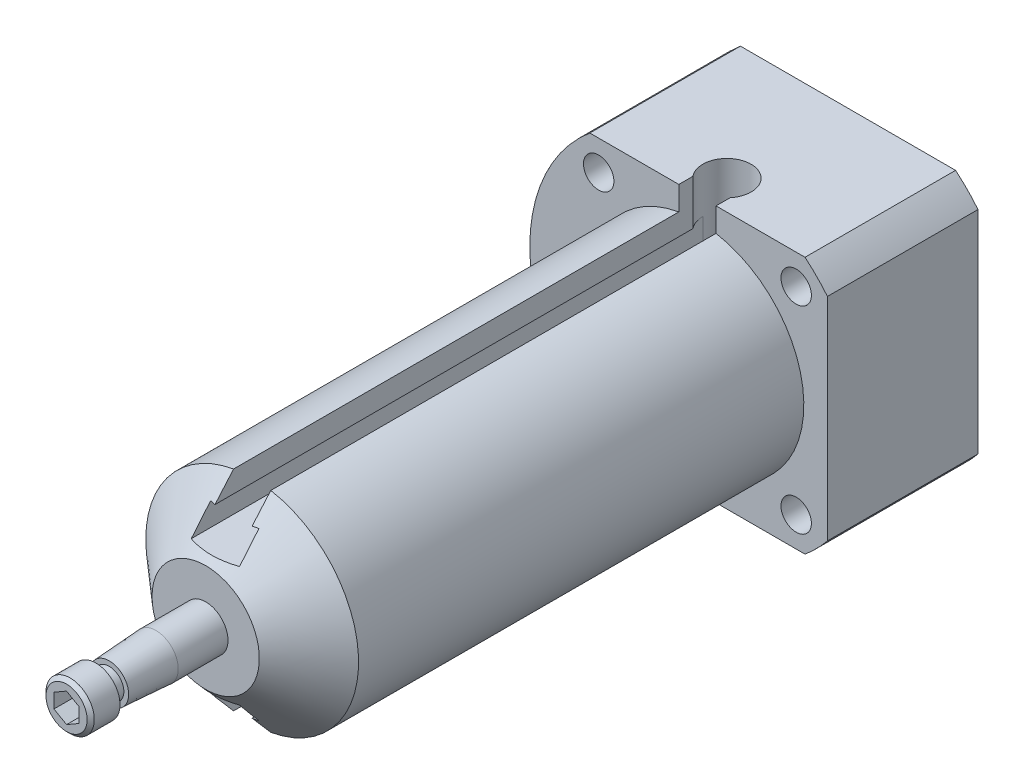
from build123d import *

# Parameters (mm, degrees)
EXTRUDE1_DEPTH     = 91.2368
HOLE1_D            = 3.4544
HOLE1_DEPTH        = 19.05
HOLE1_TIP          = 1.037806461
HOLE2_D            = 4.318
CIRPATTERN1_COUNT  = 4
CUT_EXTRUDE1_DEPTH = 74.041
CUT_EXTRUDE2_DEPTH = 53.975
CUT_EXTRUDE3_REACH = 115.64
SKETCH14_R         = 3.429
CUT_EXTRUDE4_REACH = 115.64
SKETCH15_R         = 3.429
CUT_EXTRUDE5_DEPTH = 3.175


with BuildPart() as part:
    # Sketch1 → Extrude1 (new body)
    with BuildSketch(Plane.XY):
        with BuildLine():
            Line((-15.281118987, 18.2626), (15.281118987, 18.2626))
            ThreePointArc((15.281118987, 18.2626), (16.95045971, 16.724744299), (18.4658, 15.034938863))
            Line((18.4658, 15.034938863), (18.4658, -15.034938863))
            ThreePointArc((18.4658, -15.034938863), (16.95045971, -16.724744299), (15.281118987, -18.2626))
            Line((15.281118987, -18.2626), (-15.281118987, -18.2626))
            ThreePointArc((-15.281118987, -18.2626), (-23.8125, 0), (-15.281118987, 18.2626))
        make_face()
    extrude(amount=EXTRUDE1_DEPTH)

    # Sketch2 → Cut-Revolve1 (revolve, cut)
    with BuildSketch(Plane(origin=(0, 0, 0), x_dir=(1, 0, 0), z_dir=(0, 1, 0))):
        Polygon((-23.8125, -21.3868), (-15.113, -21.3868), (-15.113, -84.6328), (-7.62, -91.2368), (-23.8125, -91.2368), align=None)
    revolve(axis=Axis((0, 0, 0), (0, 0, 1)), mode=Mode.SUBTRACT)

    # Sketch4 → Revolve1 (revolve)
    with BuildSketch(Plane(origin=(0, 0, 0), x_dir=(1, 0, 0), z_dir=(0, 1, 0))):
        Polygon((-3.16865, -91.2368), (-3.16865, -98.298), (-2.76225, -104.942581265), (0, -104.942581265), (0, -91.2368), align=None)
    revolve(axis=Axis((0, 0, 0), (0, 0, 1)))

    # Hole1
    with Locations(Plane.XY.offset(104.942581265)):
        with Locations((0, 0)):
            Hole(HOLE1_D / 2, depth=HOLE1_DEPTH)
            with Locations((0, 0, -(HOLE1_DEPTH + HOLE1_TIP / 2))):  # 118° drill point
                Cone(0, HOLE1_D / 2, HOLE1_TIP, mode=Mode.SUBTRACT)

    # Hole2 (through all)
    with Locations(Plane.XY.offset(21.3868)):
        with Locations((14.027160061, 14.027160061)):
            hole2 = Hole(HOLE2_D / 2)

    # CirPattern1: Hole2 ×4 about axis
    cirpattern1_axis = Axis((0, 0, 0), (0, 0, 1))
    for i in range(1, CIRPATTERN1_COUNT):
        add(hole2.rotate(cirpattern1_axis, i * 360 / CIRPATTERN1_COUNT), mode=Mode.SUBTRACT)

    # Sketch11 → Cut-Revolve2 (revolve, cut)
    with BuildSketch(Plane(origin=(0, 0, 14.2748), x_dir=(-1, 0, 0), z_dir=(0, 0, -1))):
        Polygon((56.532168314, 28.521824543), (9.770521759, 8.672683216), (11.398151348, 4.838228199), (58.159797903, 24.687369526), align=None)
    cut_revolve2 = revolve(axis=Axis((0, 0, 14.2748), (-0.9205048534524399, 0.39073112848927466, 0)), mode=Mode.SUBTRACT)

    # Mirror1: Cut-Revolve2 across plane
    add(cut_revolve2.mirror(Plane.ZX), mode=Mode.SUBTRACT)

    # Sketch12 → Cut-Extrude1 (cut)
    with BuildSketch(Plane.XY.offset(91.2368)):
        Polygon((-2.6416, 50.8), (-2.6416, 11.8237), (-3.429, 11.8237), (-3.429, 8.5217), (3.429, 8.5217), (3.429, 11.8237), (2.6416, 11.8237), (2.6416, 50.8), align=None)
    extrude(amount=-CUT_EXTRUDE1_DEPTH, mode=Mode.SUBTRACT)

    # Sketch13 → Cut-Extrude2 (cut)
    with BuildSketch(Plane.XY.offset(91.2368)):
        Polygon((-3.429, -8.5217), (3.429, -8.5217), (3.429, -11.8237), (2.6416, -11.8237), (2.6416, -50.8), (-2.6416, -50.8), (-2.6416, -11.8237), (-3.429, -11.8237), align=None)
    extrude(amount=-CUT_EXTRUDE2_DEPTH, mode=Mode.SUBTRACT)

    # Cut-Extrude3: up to this face of the body (flat: up to its plane)
    cut_extrude3_end = Plane(part.part.faces().sort_by_distance((0, 8.5217, 53.720140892))[0])
    # Sketch14 → Cut-Extrude3 (cut, up to the picked face)
    with BuildSketch(Plane(origin=(0, 18.2626, 0), x_dir=(1, 0, 0), z_dir=(0, 1, 0)), mode=Mode.PRIVATE) as cut_extrude3_sk1:
        with Locations((0, -17.1958)):
            Circle(SKETCH14_R)
    cut_extrude3_tool1 = split(extrude(cut_extrude3_sk1.sketch, amount=-CUT_EXTRUDE3_REACH, mode=Mode.PRIVATE), bisect_by=cut_extrude3_end, keep=Keep.BOTH, mode=Mode.PRIVATE)
    add(cut_extrude3_tool1.solids().sort_by(Axis((0, 18.2626, 17.1958), (0, -1, 0)))[0], mode=Mode.SUBTRACT)

    # Cut-Extrude4: up to this face of the body (flat: up to its plane)
    cut_extrude4_end = Plane(part.part.faces().sort_by_distance((0, -8.5217, 63.753220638))[0])
    # Sketch15 → Cut-Extrude4 (cut, up to the picked face)
    with BuildSketch(Plane.XZ.offset(18.2626), mode=Mode.PRIVATE) as cut_extrude4_sk1:
        with Locations((0, 37.2618)):
            Circle(SKETCH15_R)
    cut_extrude4_tool1 = split(extrude(cut_extrude4_sk1.sketch, amount=-CUT_EXTRUDE4_REACH, mode=Mode.PRIVATE), bisect_by=cut_extrude4_end, keep=Keep.BOTH, mode=Mode.PRIVATE)
    add(cut_extrude4_tool1.solids().sort_by(Axis((0, -18.2626, 37.2618), (0, 1, 0)))[0], mode=Mode.SUBTRACT)

    # Sketch16 → Revolve2 (revolve)
    with BuildSketch(Plane(origin=(0, 0, 0), x_dir=(1, 0, 0), z_dir=(0, 1, 0))):
        Polygon((-2.0828, -104.942581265), (-2.0828, -106.8324), (-3.429, -106.8324), (-3.429, -110.49), (-2.921, -110.998), (0, -110.998), (0, -104.942581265), align=None)
    revolve(axis=Axis((0, 0, 0), (0, 0, 1)))

    # Sketch17 → Cut-Extrude5 (cut)
    with BuildSketch(Plane.XY.offset(110.998)):
        Polygon((1.7859375, -1.031111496), (1.7859375, 1.031111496), (0, 2.062222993), (-1.7859375, 1.031111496), (-1.7859375, -1.031111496), (0, -2.062222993), align=None)
    extrude(amount=-CUT_EXTRUDE5_DEPTH, mode=Mode.SUBTRACT)


solid = part.part
